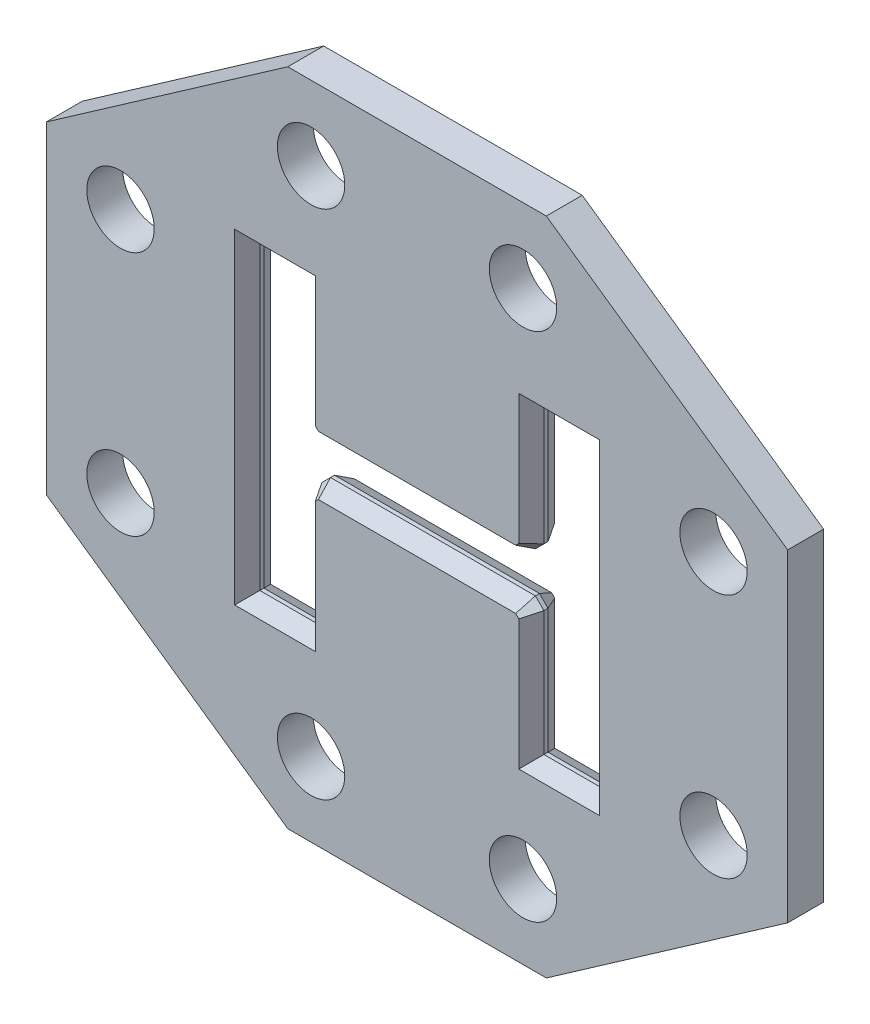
from build123d import *

# Parameters (mm, degrees)
MAIN_PLATE_DEPTH   = 25.4
SKETCH7_W          = 497.538687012
SKETCH7_H          = 609.547031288
EXTRUDE_W500_DEPTH = 25.4
HOLES_DEPTH        = 702.803266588
HOLES_DEPTH_BACK   = 702.803266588
SKETCH5_R          = 47.625
CHAMFER1_SIZE      = 13
CHAMFER1_SIZE2     = 22.516660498
CHAMFER2_SIZE      = 13
CHAMFER2_SIZE2     = 22.516660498


with BuildPart() as part:
    # Sketch3 → Main Plate (new, symmetric)
    with BuildSketch(Plane(origin=(0, 0, 0), x_dir=(0, 1, 0), z_dir=(0, 0, 1))):
        Polygon((228.234235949, 523.855268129), (466.324268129, 182.70492307), (466.324268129, -182.70492307), (228.234235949, -523.855268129), (-228.234235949, -523.855268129), (-466.324268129, -182.70492307), (-466.324268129, 182.70492307), (-228.234235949, 523.855268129), align=None)
        Polygon((-54.229, 156.845), (-230.378, 156.845), (-230.378, 287.909), (230.378, 287.909), (230.378, 156.845), (54.229, 156.845), (42.164, 144.78), (42.164, -144.78), (54.229, -156.845), (230.378, -156.845), (230.378, -287.909), (-230.378, -287.909), (-230.378, -156.845), (-54.229, -156.845), (-42.164, -144.78), (-42.164, 144.78), align=None, mode=Mode.SUBTRACT)
    extrude(amount=MAIN_PLATE_DEPTH, both=True)

    # Sketch7 → Extrude w500 (add, symmetric)
    with BuildSketch(Plane(origin=(0, 0, 0), x_dir=(0, 1, 0), z_dir=(0, 0, 1))):
        with Locations((1.117579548, 1.96521309)):
            Rectangle(SKETCH7_W, SKETCH7_H)
        Polygon((28.7655, 144.78), (28.7655, -144.78), (40.8305, -156.845), (216.9795, -156.845), (216.9795, -244.729), (-216.9795, -244.729), (-216.9795, -156.845), (-40.8305, -156.845), (-28.7655, -144.78), (-28.7655, 144.78), (-40.8305, 156.845), (-216.9795, 156.845), (-216.9795, 244.729), (216.9795, 244.729), (216.9795, 156.845), (40.8305, 156.845), align=None, mode=Mode.SUBTRACT)
    extrude(amount=EXTRUDE_W500_DEPTH, both=True)

    # Sketch5 → holes (cut, two sides: drawn at the far end of the back side and taken through both)
    with BuildSketch(Plane(origin=(0, 0, 0), x_dir=(0, 1, 0), z_dir=(0, 0, 1)).offset(-HOLES_DEPTH_BACK)):
        with Locations(Location((-173.588730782, 419.080268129, 0), (0, 0, 270))):
            Circle(SKETCH5_R)
        with Locations(Location((173.588730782, 419.080268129, 0), (0, 0, 270))):
            Circle(SKETCH5_R)
        with Locations(Location((361.549268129, 149.758610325, 0), (0, 0, 270))):
            Circle(SKETCH5_R)
        with Locations(Location((361.549268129, -149.758610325, 0), (0, 0, 270))):
            Circle(SKETCH5_R)
        with Locations(Location((173.588730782, -419.080268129, 0), (0, 0, 270))):
            Circle(SKETCH5_R)
        with Locations(Location((-173.588730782, -419.080268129, 0), (0, 0, 270))):
            Circle(SKETCH5_R)
        with Locations(Location((-361.549268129, -149.758610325, 0), (0, 0, 270))):
            Circle(SKETCH5_R)
        with Locations(Location((-361.549268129, 149.758610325, 0), (0, 0, 270))):
            Circle(SKETCH5_R)
    extrude(amount=HOLES_DEPTH + HOLES_DEPTH_BACK, mode=Mode.SUBTRACT)

    # Chamfer1
    chamfer1_edges = [part.edges().sort_by_distance(p)[0] for p in [
        (-200.787, 216.9795, 25.4),
        (-244.729, 0, 25.4),
        (-200.787, -216.9795, 25.4),
        (-150.8125, -34.798, 25.4),
        (0, -28.7655, 25.4),
        (150.8125, -34.798, 25.4),
        (200.787, -216.9795, 25.4),
        (244.729, 0, 25.4),
        (200.787, 216.9795, 25.4),
        (150.8125, 34.798, 25.4),
        (0, 28.7655, 25.4),
        (156.845, -128.905, 25.4),
        (-156.845, 128.905, 25.4),
        (-156.845, -128.905, 25.4),
        (156.845, 128.905, 25.4),
        (-150.8125, 34.798, 25.4),
    ]]
    chamfer1_side = [part.faces().sort_by_distance(p)[0] for p in [
        (-345.252406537, 335.776675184, 25.4),
    ]]
    chamfer(chamfer1_edges, length=CHAMFER1_SIZE, length2=CHAMFER1_SIZE2, reference=chamfer1_side[0])

    # Chamfer2
    chamfer2_edges = [part.edges().sort_by_distance(p)[0] for p in [
        (156.845, -128.905, -25.4),
        (-156.845, 128.905, -25.4),
        (-156.845, -128.905, -25.4),
        (156.845, 128.905, -25.4),
        (150.8125, 34.798, -25.4),
        (0, 28.7655, -25.4),
        (-150.8125, 34.798, -25.4),
        (200.787, -216.9795, -25.4),
        (244.729, 0, -25.4),
        (200.787, 216.9795, -25.4),
        (-200.787, 216.9795, -25.4),
        (-244.729, 0, -25.4),
        (-200.787, -216.9795, -25.4),
        (-150.8125, -34.798, -25.4),
        (0, -28.7655, -25.4),
        (150.8125, -34.798, -25.4),
    ]]
    chamfer2_side = [part.faces().sort_by_distance(p)[0] for p in [
        (-345.252406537, 335.776675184, -25.4),
    ]]
    chamfer(chamfer2_edges, length=CHAMFER2_SIZE, length2=CHAMFER2_SIZE2, reference=chamfer2_side[0])


solid = part.part
